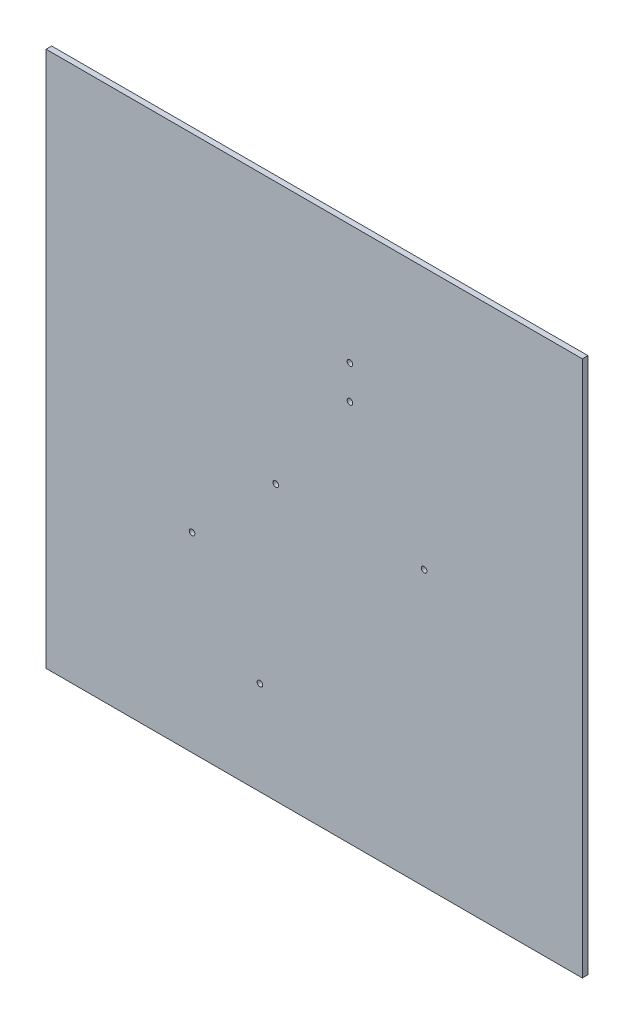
from build123d import *

# Parameters (mm, degrees)
SKETCH1_W           = 304.8
SKETCH1_H           = 304.8
SKETCH1_R           = 1.5875
BOSS_EXTRUDE1_DEPTH = 3.175


with BuildPart() as part:
    # Sketch1 → Boss-Extrude1 (new body)
    with BuildSketch(Plane.XY):
        with Locations((152.4, 152.4)):
            Rectangle(SKETCH1_W, SKETCH1_H)
        with Locations((130.547161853, 156.033483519)):
            Circle(SKETCH1_R, mode=Mode.SUBTRACT)
        with Locations((214.875161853, 156.033483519)):
            Circle(SKETCH1_R, mode=Mode.SUBTRACT)
        with Locations((82.951804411, 108.438126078)):
            Circle(SKETCH1_R, mode=Mode.SUBTRACT)
        with Locations((121.559234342, 53.301001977)):
            Circle(SKETCH1_R, mode=Mode.SUBTRACT)
        with Locations((172.711161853, 217.642084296)):
            Circle(SKETCH1_R, mode=Mode.SUBTRACT)
        with Locations((172.711161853, 236.692084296)):
            Circle(SKETCH1_R, mode=Mode.SUBTRACT)
    extrude(amount=BOSS_EXTRUDE1_DEPTH)


solid = part.part
